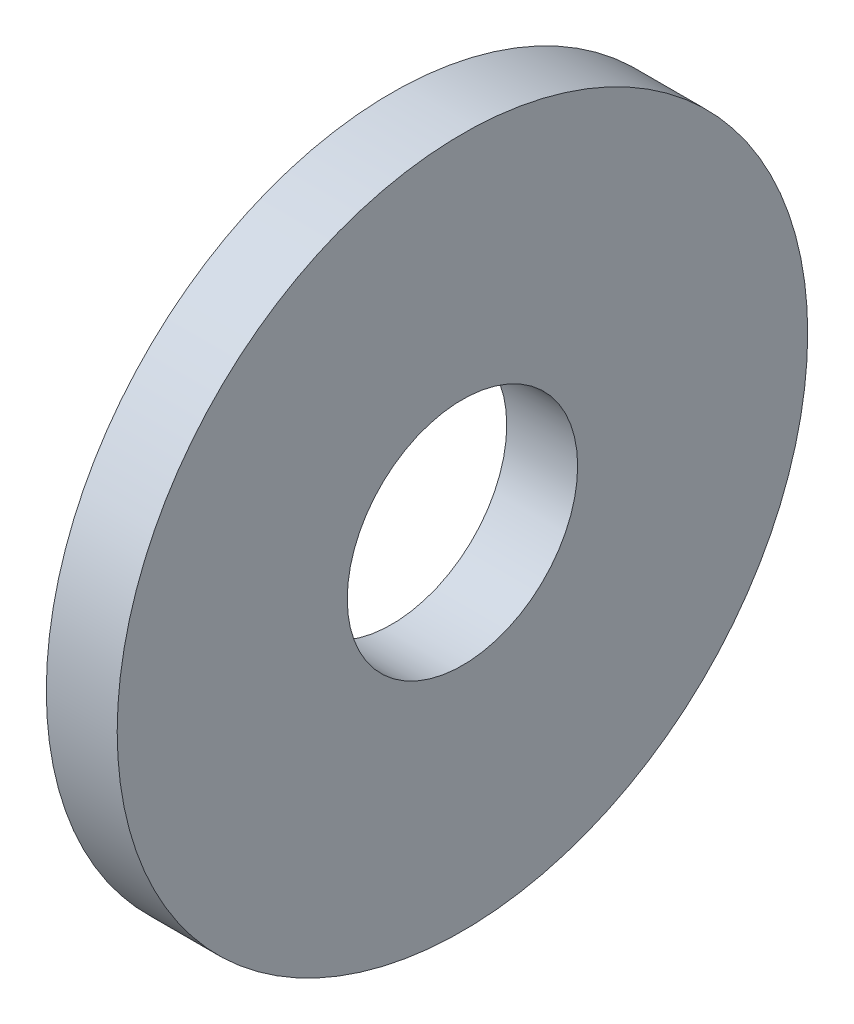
from build123d import *

# Parameters (mm, degrees)
ESBO_O1_R                = 9.74
ESBO_O1_R_2              = 3.25
RESSALTO_EXTRUS_O1_DEPTH = 2


with BuildPart() as part:
    # Esbo_o1 → Ressalto-extrus_o1 (new body)
    with BuildSketch(Plane(origin=(0, 0, 0), x_dir=(0, 0, -1), z_dir=(1, 0, 0))):
        Circle(ESBO_O1_R)
        Circle(ESBO_O1_R_2, mode=Mode.SUBTRACT)
    extrude(amount=RESSALTO_EXTRUS_O1_DEPTH)


solid = part.part
